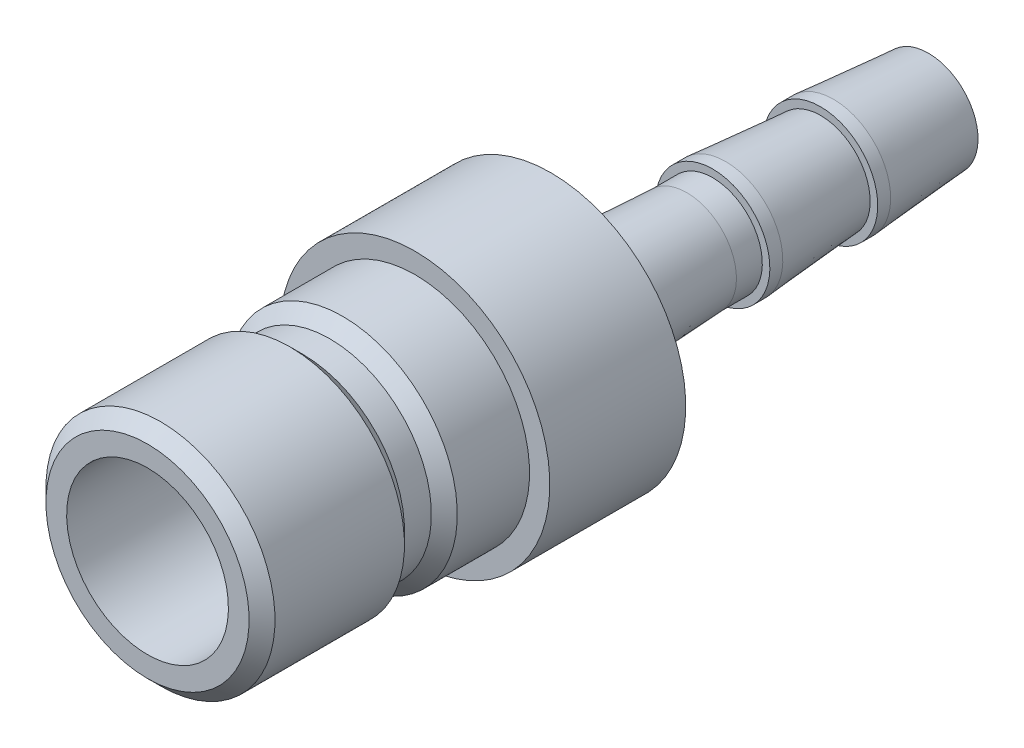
from build123d import *


with BuildPart() as part:
    # Sketch1 → Revolve1 (revolve)
    with BuildSketch(Plane(origin=(0, 0, 0), x_dir=(0, 0, -1), z_dir=(1, 0, 0))):
        Polygon((-15.748, 4.7625), (-15.748, 5.9817), (-14.986, 6.7437), (-7.366, 6.7437), (-6.604, 5.9817), (-5.0165, 5.9817), (-4.2545, 6.7437), (0, 6.7437), (0, 7.9375), (8.001, 7.9375), (8.001, 3.3655), (16.002, 2.921), (17.526, 2.921), (17.526, 3.3655), (18.288, 3.3655), (23.876, 2.921), (23.876, 3.3655), (24.638, 3.3655), (30.226, 2.921), (30.226, 2.38125), (-0.691870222, 2.38125), (-3.556, 4.7625), align=None)
    revolve(axis=Axis((0, 0, 0), (0, 0, 1)))


solid = part.part
